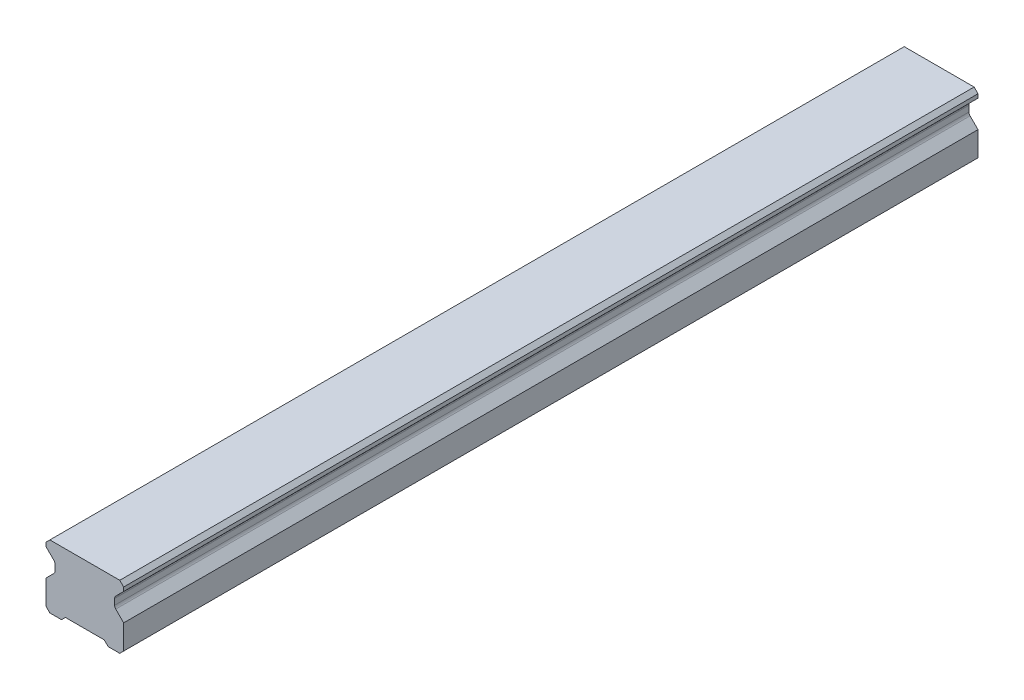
ISO-10303-21;
HEADER;
FILE_DESCRIPTION(('STEP AP214'),'2;1');
FILE_NAME('part.step','',(''),(''),'','','');
FILE_SCHEMA(('AUTOMOTIVE_DESIGN { 1 0 10303 214 1 1 1 1 }'));
ENDSEC;
DATA;
#1=APPLICATION_CONTEXT('core data for automotive mechanical design processes');
#2=APPLICATION_PROTOCOL_DEFINITION('international standard','automotive_design',2000,#1);
#3=PRODUCT_CONTEXT('',#1,'mechanical');
#4=PRODUCT('Part','Part','',(#3));
#5=PRODUCT_RELATED_PRODUCT_CATEGORY('part','',(#4));
#6=PRODUCT_DEFINITION_FORMATION('','',#4);
#7=PRODUCT_DEFINITION_CONTEXT('part definition',#1,'design');
#8=PRODUCT_DEFINITION('design','',#6,#7);
#9=PRODUCT_DEFINITION_SHAPE('','',#8);
#10=(LENGTH_UNIT() NAMED_UNIT(*) SI_UNIT(.MILLI.,.METRE.));
#11=(NAMED_UNIT(*) PLANE_ANGLE_UNIT() SI_UNIT($,.RADIAN.));
#12=(NAMED_UNIT(*) SI_UNIT($,.STERADIAN.) SOLID_ANGLE_UNIT());
#13=UNCERTAINTY_MEASURE_WITH_UNIT(LENGTH_MEASURE(1.E-05),#10,'distance_accuracy_value','');
#14=(GEOMETRIC_REPRESENTATION_CONTEXT(3) GLOBAL_UNCERTAINTY_ASSIGNED_CONTEXT((#13)) GLOBAL_UNIT_ASSIGNED_CONTEXT((#10,
#11,#12)) REPRESENTATION_CONTEXT('',''));
#15=CARTESIAN_POINT('',(0.,0.,0.));
#16=DIRECTION('',(0.,0.,1.));
#17=DIRECTION('',(1.,0.,0.));
#18=AXIS2_PLACEMENT_3D('',#15,#16,#17);
#19=CARTESIAN_POINT('',(0.,11.,-90.));
#20=DIRECTION('',(0.,-1.,0.));
#21=DIRECTION('',(0.,0.,-1.));
#22=AXIS2_PLACEMENT_3D('',#19,#20,#21);
#23=PLANE('',#22);
#24=CARTESIAN_POINT('',(0.,11.,-90.));
#25=DIRECTION('',(0.,-1.,0.));
#26=DIRECTION('',(0.,0.,-1.));
#27=AXIS2_PLACEMENT_3D('',#24,#25,#26);
#28=CIRCLE('',#27,2.5);
#29=CARTESIAN_POINT('',(0.,11.,-92.5));
#30=VERTEX_POINT('',#29);
#31=EDGE_CURVE('E42',#30,#30,#28,.T.);
#32=ORIENTED_EDGE('',*,*,#31,.F.);
#33=EDGE_LOOP('',(#32));
#34=FACE_BOUND('',#33,.T.);
#35=CARTESIAN_POINT('',(0.,11.,-90.));
#36=DIRECTION('',(0.,-1.,0.));
#37=DIRECTION('',(0.,0.,-1.));
#38=AXIS2_PLACEMENT_3D('',#35,#36,#37);
#39=CIRCLE('',#38,3.);
#40=CARTESIAN_POINT('',(0.,11.,-93.));
#41=VERTEX_POINT('',#40);
#42=EDGE_CURVE('E11',#41,#41,#39,.T.);
#43=ORIENTED_EDGE('',*,*,#42,.T.);
#44=EDGE_LOOP('',(#43));
#45=FACE_BOUND('',#44,.T.);
#46=ADVANCED_FACE('F39',(#34,#45),#23,.T.);
#47=CARTESIAN_POINT('',(0.,11.,-90.));
#48=DIRECTION('',(0.,-1.,0.));
#49=DIRECTION('',(0.,0.,-1.));
#50=AXIS2_PLACEMENT_3D('',#47,#48,#49);
#51=CYLINDRICAL_SURFACE('',#50,3.);
#52=ORIENTED_EDGE('',*,*,#42,.F.);
#53=EDGE_LOOP('',(#52));
#54=FACE_BOUND('',#53,.T.);
#55=CARTESIAN_POINT('',(0.,1.00000000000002,-90.));
#56=DIRECTION('',(0.,-1.,0.));
#57=DIRECTION('',(0.,0.,-1.));
#58=AXIS2_PLACEMENT_3D('',#55,#56,#57);
#59=CIRCLE('',#58,3.);
#60=CARTESIAN_POINT('',(0.,1.00000000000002,-93.));
#61=VERTEX_POINT('',#60);
#62=EDGE_CURVE('E48',#61,#61,#59,.T.);
#63=ORIENTED_EDGE('',*,*,#62,.T.);
#64=EDGE_LOOP('',(#63));
#65=FACE_BOUND('',#64,.T.);
#66=ADVANCED_FACE('F519',(#54,#65),#51,.F.);
#67=CARTESIAN_POINT('',(0.,11.,-30.));
#68=DIRECTION('',(0.,-1.,0.));
#69=DIRECTION('',(0.,0.,-1.));
#70=AXIS2_PLACEMENT_3D('',#67,#68,#69);
#71=PLANE('',#70);
#72=CARTESIAN_POINT('',(0.,11.,-30.));
#73=DIRECTION('',(0.,-1.,0.));
#74=DIRECTION('',(0.,0.,-1.));
#75=AXIS2_PLACEMENT_3D('',#72,#73,#74);
#76=CIRCLE('',#75,2.5);
#77=CARTESIAN_POINT('',(0.,11.,-32.5));
#78=VERTEX_POINT('',#77);
#79=EDGE_CURVE('E230',#78,#78,#76,.T.);
#80=ORIENTED_EDGE('',*,*,#79,.F.);
#81=EDGE_LOOP('',(#80));
#82=FACE_BOUND('',#81,.T.);
#83=CARTESIAN_POINT('',(0.,11.,-30.));
#84=DIRECTION('',(0.,-1.,0.));
#85=DIRECTION('',(0.,0.,-1.));
#86=AXIS2_PLACEMENT_3D('',#83,#84,#85);
#87=CIRCLE('',#86,3.);
#88=CARTESIAN_POINT('',(0.,11.,-33.));
#89=VERTEX_POINT('',#88);
#90=EDGE_CURVE('E500',#89,#89,#87,.T.);
#91=ORIENTED_EDGE('',*,*,#90,.T.);
#92=EDGE_LOOP('',(#91));
#93=FACE_BOUND('',#92,.T.);
#94=ADVANCED_FACE('F524',(#82,#93),#71,.T.);
#95=CARTESIAN_POINT('',(0.,11.,-30.));
#96=DIRECTION('',(0.,-1.,0.));
#97=DIRECTION('',(0.,0.,-1.));
#98=AXIS2_PLACEMENT_3D('',#95,#96,#97);
#99=CYLINDRICAL_SURFACE('',#98,3.);
#100=ORIENTED_EDGE('',*,*,#90,.F.);
#101=EDGE_LOOP('',(#100));
#102=FACE_BOUND('',#101,.T.);
#103=CARTESIAN_POINT('',(0.,1.00000000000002,-30.));
#104=DIRECTION('',(0.,-1.,0.));
#105=DIRECTION('',(0.,0.,-1.));
#106=AXIS2_PLACEMENT_3D('',#103,#104,#105);
#107=CIRCLE('',#106,3.);
#108=CARTESIAN_POINT('',(0.,1.00000000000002,-33.));
#109=VERTEX_POINT('',#108);
#110=EDGE_CURVE('E496',#109,#109,#107,.T.);
#111=ORIENTED_EDGE('',*,*,#110,.T.);
#112=EDGE_LOOP('',(#111));
#113=FACE_BOUND('',#112,.T.);
#114=ADVANCED_FACE('F628',(#102,#113),#99,.F.);
#115=CARTESIAN_POINT('',(10.,0.,110.));
#116=DIRECTION('',(0.,1.,0.));
#117=DIRECTION('',(-1.,0.,0.));
#118=AXIS2_PLACEMENT_3D('',#115,#116,#117);
#119=PLANE('',#118);
#120=DIRECTION('',(1.,0.,0.));
#121=VECTOR('',#120,1.);
#122=CARTESIAN_POINT('',(10.,0.,-110.));
#123=LINE('',#122,#121);
#124=CARTESIAN_POINT('',(-9.,0.,-110.));
#125=VERTEX_POINT('',#124);
#126=CARTESIAN_POINT('',(-6.00000000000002,0.,-110.));
#127=VERTEX_POINT('',#126);
#128=EDGE_CURVE('E380',#125,#127,#123,.T.);
#129=ORIENTED_EDGE('',*,*,#128,.T.);
#130=DIRECTION('',(0.,0.,1.));
#131=VECTOR('',#130,1.);
#132=CARTESIAN_POINT('',(-6.00000000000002,0.,-110.));
#133=LINE('',#132,#131);
#134=CARTESIAN_POINT('',(-6.00000000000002,0.,110.));
#135=VERTEX_POINT('',#134);
#136=EDGE_CURVE('E285',#127,#135,#133,.T.);
#137=ORIENTED_EDGE('',*,*,#136,.T.);
#138=DIRECTION('',(1.,0.,0.));
#139=VECTOR('',#138,1.);
#140=CARTESIAN_POINT('',(10.,0.,110.));
#141=LINE('',#140,#139);
#142=CARTESIAN_POINT('',(-9.,0.,110.));
#143=VERTEX_POINT('',#142);
#144=EDGE_CURVE('E361',#143,#135,#141,.T.);
#145=ORIENTED_EDGE('',*,*,#144,.F.);
#146=DIRECTION('',(0.,0.,-1.));
#147=VECTOR('',#146,1.);
#148=CARTESIAN_POINT('',(-9.,0.,110.));
#149=LINE('',#148,#147);
#150=EDGE_CURVE('E432',#143,#125,#149,.T.);
#151=ORIENTED_EDGE('',*,*,#150,.T.);
#152=EDGE_LOOP('',(#129,#137,#145,#151));
#153=FACE_BOUND('',#152,.T.);
#154=ADVANCED_FACE('F593',(#153),#119,.F.);
#155=CARTESIAN_POINT('',(-10.,16.3,110.));
#156=DIRECTION('',(1.,0.,0.));
#157=DIRECTION('',(0.,1.,0.));
#158=AXIS2_PLACEMENT_3D('',#155,#156,#157);
#159=PLANE('',#158);
#160=DIRECTION('',(0.,-1.,0.));
#161=VECTOR('',#160,1.);
#162=CARTESIAN_POINT('',(-10.,16.3,110.));
#163=LINE('',#162,#161);
#164=CARTESIAN_POINT('',(-10.,15.3,110.));
#165=VERTEX_POINT('',#164);
#166=CARTESIAN_POINT('',(-10.,14.3,110.));
#167=VERTEX_POINT('',#166);
#168=EDGE_CURVE('E355',#165,#167,#163,.T.);
#169=ORIENTED_EDGE('',*,*,#168,.F.);
#170=DIRECTION('',(0.,0.,-1.));
#171=VECTOR('',#170,1.);
#172=CARTESIAN_POINT('',(-10.,15.3,110.));
#173=LINE('',#172,#171);
#174=CARTESIAN_POINT('',(-10.,15.3,-110.));
#175=VERTEX_POINT('',#174);
#176=EDGE_CURVE('E374',#165,#175,#173,.T.);
#177=ORIENTED_EDGE('',*,*,#176,.T.);
#178=DIRECTION('',(0.,-1.,0.));
#179=VECTOR('',#178,1.);
#180=CARTESIAN_POINT('',(-10.,16.3,-110.));
#181=LINE('',#180,#179);
#182=CARTESIAN_POINT('',(-10.,14.3,-110.));
#183=VERTEX_POINT('',#182);
#184=EDGE_CURVE('E375',#175,#183,#181,.T.);
#185=ORIENTED_EDGE('',*,*,#184,.T.);
#186=DIRECTION('',(0.,0.,1.));
#187=VECTOR('',#186,1.);
#188=CARTESIAN_POINT('',(-10.,14.3,-110.));
#189=LINE('',#188,#187);
#190=EDGE_CURVE('E309',#183,#167,#189,.T.);
#191=ORIENTED_EDGE('',*,*,#190,.T.);
#192=EDGE_LOOP('',(#169,#177,#185,#191));
#193=FACE_BOUND('',#192,.T.);
#194=ADVANCED_FACE('F597',(#193),#159,.F.);
#195=CARTESIAN_POINT('',(10.,16.3,110.));
#196=DIRECTION('',(-1.,0.,0.));
#197=DIRECTION('',(0.,-1.,0.));
#198=AXIS2_PLACEMENT_3D('',#195,#196,#197);
#199=PLANE('',#198);
#200=DIRECTION('',(0.,1.,0.));
#201=VECTOR('',#200,1.);
#202=CARTESIAN_POINT('',(10.,16.3,110.));
#203=LINE('',#202,#201);
#204=CARTESIAN_POINT('',(10.,0.999999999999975,110.));
#205=VERTEX_POINT('',#204);
#206=CARTESIAN_POINT('',(10.,7.3,110.));
#207=VERTEX_POINT('',#206);
#208=EDGE_CURVE('E366',#205,#207,#203,.T.);
#209=ORIENTED_EDGE('',*,*,#208,.F.);
#210=DIRECTION('',(0.,0.,-1.));
#211=VECTOR('',#210,1.);
#212=CARTESIAN_POINT('',(10.,0.999999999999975,110.));
#213=LINE('',#212,#211);
#214=CARTESIAN_POINT('',(10.,0.999999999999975,-110.));
#215=VERTEX_POINT('',#214);
#216=EDGE_CURVE('E438',#205,#215,#213,.T.);
#217=ORIENTED_EDGE('',*,*,#216,.T.);
#218=DIRECTION('',(0.,1.,0.));
#219=VECTOR('',#218,1.);
#220=CARTESIAN_POINT('',(10.,16.3,-110.));
#221=LINE('',#220,#219);
#222=CARTESIAN_POINT('',(10.,7.3,-110.));
#223=VERTEX_POINT('',#222);
#224=EDGE_CURVE('E385',#215,#223,#221,.T.);
#225=ORIENTED_EDGE('',*,*,#224,.T.);
#226=DIRECTION('',(0.,0.,1.));
#227=VECTOR('',#226,1.);
#228=CARTESIAN_POINT('',(10.,7.3,-110.));
#229=LINE('',#228,#227);
#230=EDGE_CURVE('E340',#223,#207,#229,.T.);
#231=ORIENTED_EDGE('',*,*,#230,.T.);
#232=EDGE_LOOP('',(#209,#217,#225,#231));
#233=FACE_BOUND('',#232,.T.);
#234=ADVANCED_FACE('F588',(#233),#199,.F.);
#235=CARTESIAN_POINT('',(-10.,7.3,-110.));
#236=VERTEX_POINT('',#235);
#237=CARTESIAN_POINT('',(-10.,1.00000000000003,-110.));
#238=VERTEX_POINT('',#237);
#239=EDGE_CURVE('E324',#236,#238,#181,.T.);
#240=ORIENTED_EDGE('',*,*,#239,.T.);
#241=DIRECTION('',(0.,0.,1.));
#242=VECTOR('',#241,1.);
#243=CARTESIAN_POINT('',(-10.,1.00000000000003,110.));
#244=LINE('',#243,#242);
#245=CARTESIAN_POINT('',(-10.,1.00000000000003,110.));
#246=VERTEX_POINT('',#245);
#247=EDGE_CURVE('E435',#238,#246,#244,.T.);
#248=ORIENTED_EDGE('',*,*,#247,.T.);
#249=CARTESIAN_POINT('',(-10.,7.3,110.));
#250=VERTEX_POINT('',#249);
#251=EDGE_CURVE('E360',#250,#246,#163,.T.);
#252=ORIENTED_EDGE('',*,*,#251,.F.);
#253=DIRECTION('',(0.,0.,1.));
#254=VECTOR('',#253,1.);
#255=CARTESIAN_POINT('',(-10.,7.3,-110.));
#256=LINE('',#255,#254);
#257=EDGE_CURVE('E321',#236,#250,#256,.T.);
#258=ORIENTED_EDGE('',*,*,#257,.F.);
#259=EDGE_LOOP('',(#240,#248,#252,#258));
#260=FACE_BOUND('',#259,.T.);
#261=ADVANCED_FACE('F591',(#260),#159,.F.);
#262=CARTESIAN_POINT('',(6.00000000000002,0.,110.));
#263=VERTEX_POINT('',#262);
#264=CARTESIAN_POINT('',(9.,0.,110.));
#265=VERTEX_POINT('',#264);
#266=EDGE_CURVE('E359',#263,#265,#141,.T.);
#267=ORIENTED_EDGE('',*,*,#266,.F.);
#268=DIRECTION('',(0.,0.,1.));
#269=VECTOR('',#268,1.);
#270=CARTESIAN_POINT('',(6.00000000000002,0.,-110.));
#271=LINE('',#270,#269);
#272=CARTESIAN_POINT('',(6.00000000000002,0.,-110.));
#273=VERTEX_POINT('',#272);
#274=EDGE_CURVE('E275',#273,#263,#271,.T.);
#275=ORIENTED_EDGE('',*,*,#274,.F.);
#276=CARTESIAN_POINT('',(9.,0.,-110.));
#277=VERTEX_POINT('',#276);
#278=EDGE_CURVE('E379',#273,#277,#123,.T.);
#279=ORIENTED_EDGE('',*,*,#278,.T.);
#280=DIRECTION('',(0.,0.,1.));
#281=VECTOR('',#280,1.);
#282=CARTESIAN_POINT('',(9.,0.,110.));
#283=LINE('',#282,#281);
#284=EDGE_CURVE('E428',#277,#265,#283,.T.);
#285=ORIENTED_EDGE('',*,*,#284,.T.);
#286=EDGE_LOOP('',(#267,#275,#279,#285));
#287=FACE_BOUND('',#286,.T.);
#288=ADVANCED_FACE('F586',(#287),#119,.F.);
#289=CARTESIAN_POINT('',(10.,14.3,-110.));
#290=VERTEX_POINT('',#289);
#291=CARTESIAN_POINT('',(10.,15.3,-110.));
#292=VERTEX_POINT('',#291);
#293=EDGE_CURVE('E384',#290,#292,#221,.T.);
#294=ORIENTED_EDGE('',*,*,#293,.T.);
#295=DIRECTION('',(0.,0.,1.));
#296=VECTOR('',#295,1.);
#297=CARTESIAN_POINT('',(10.,15.3,110.));
#298=LINE('',#297,#296);
#299=CARTESIAN_POINT('',(10.,15.3,110.));
#300=VERTEX_POINT('',#299);
#301=EDGE_CURVE('E442',#292,#300,#298,.T.);
#302=ORIENTED_EDGE('',*,*,#301,.T.);
#303=CARTESIAN_POINT('',(10.,14.3,110.));
#304=VERTEX_POINT('',#303);
#305=EDGE_CURVE('E365',#304,#300,#203,.T.);
#306=ORIENTED_EDGE('',*,*,#305,.F.);
#307=DIRECTION('',(0.,0.,1.));
#308=VECTOR('',#307,1.);
#309=CARTESIAN_POINT('',(10.,14.3,-110.));
#310=LINE('',#309,#308);
#311=EDGE_CURVE('E314',#290,#304,#310,.T.);
#312=ORIENTED_EDGE('',*,*,#311,.F.);
#313=EDGE_LOOP('',(#294,#302,#306,#312));
#314=FACE_BOUND('',#313,.T.);
#315=ADVANCED_FACE('F582',(#314),#199,.F.);
#316=CARTESIAN_POINT('',(10.,16.3,110.));
#317=DIRECTION('',(0.,-1.,0.));
#318=DIRECTION('',(0.,0.,-1.));
#319=AXIS2_PLACEMENT_3D('',#316,#317,#318);
#320=PLANE('',#319);
#321=DIRECTION('',(-1.,0.,0.));
#322=VECTOR('',#321,1.);
#323=CARTESIAN_POINT('',(10.,16.3,-110.));
#324=LINE('',#323,#322);
#325=CARTESIAN_POINT('',(9.00000000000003,16.3,-110.));
#326=VERTEX_POINT('',#325);
#327=CARTESIAN_POINT('',(-9.,16.3,-110.));
#328=VERTEX_POINT('',#327);
#329=EDGE_CURVE('E389',#326,#328,#324,.T.);
#330=ORIENTED_EDGE('',*,*,#329,.T.);
#331=DIRECTION('',(0.,0.,1.));
#332=VECTOR('',#331,1.);
#333=CARTESIAN_POINT('',(-9.,16.3,110.));
#334=LINE('',#333,#332);
#335=CARTESIAN_POINT('',(-9.,16.3,110.));
#336=VERTEX_POINT('',#335);
#337=EDGE_CURVE('E413',#328,#336,#334,.T.);
#338=ORIENTED_EDGE('',*,*,#337,.T.);
#339=DIRECTION('',(-1.,0.,0.));
#340=VECTOR('',#339,1.);
#341=CARTESIAN_POINT('',(10.,16.3,110.));
#342=LINE('',#341,#340);
#343=CARTESIAN_POINT('',(9.00000000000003,16.3,110.));
#344=VERTEX_POINT('',#343);
#345=EDGE_CURVE('E370',#344,#336,#342,.T.);
#346=ORIENTED_EDGE('',*,*,#345,.F.);
#347=DIRECTION('',(0.,0.,-1.));
#348=VECTOR('',#347,1.);
#349=CARTESIAN_POINT('',(9.00000000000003,16.3,110.));
#350=LINE('',#349,#348);
#351=EDGE_CURVE('E409',#344,#326,#350,.T.);
#352=ORIENTED_EDGE('',*,*,#351,.T.);
#353=EDGE_LOOP('',(#330,#338,#346,#352));
#354=FACE_BOUND('',#353,.T.);
#355=ADVANCED_FACE('F576',(#354),#320,.F.);
#356=CARTESIAN_POINT('',(0.,0.,110.));
#357=DIRECTION('',(0.,0.,-1.));
#358=DIRECTION('',(-1.,0.,0.));
#359=AXIS2_PLACEMENT_3D('',#356,#357,#358);
#360=PLANE('',#359);
#361=ORIENTED_EDGE('',*,*,#144,.T.);
#362=DIRECTION('',(-0.707106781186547,-0.707106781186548,0.));
#363=VECTOR('',#362,1.);
#364=CARTESIAN_POINT('',(-6.00000000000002,0.,110.));
#365=LINE('',#364,#363);
#366=CARTESIAN_POINT('',(-5.,1.00000000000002,110.));
#367=VERTEX_POINT('',#366);
#368=EDGE_CURVE('E268',#367,#135,#365,.T.);
#369=ORIENTED_EDGE('',*,*,#368,.F.);
#370=DIRECTION('',(-1.,0.,0.));
#371=VECTOR('',#370,1.);
#372=CARTESIAN_POINT('',(-5.,1.00000000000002,110.));
#373=LINE('',#372,#371);
#374=CARTESIAN_POINT('',(5.,1.00000000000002,110.));
#375=VERTEX_POINT('',#374);
#376=EDGE_CURVE('E279',#375,#367,#373,.T.);
#377=ORIENTED_EDGE('',*,*,#376,.F.);
#378=DIRECTION('',(-0.707106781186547,0.707106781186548,0.));
#379=VECTOR('',#378,1.);
#380=CARTESIAN_POINT('',(5.,1.00000000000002,110.));
#381=LINE('',#380,#379);
#382=EDGE_CURVE('E260',#263,#375,#381,.T.);
#383=ORIENTED_EDGE('',*,*,#382,.F.);
#384=ORIENTED_EDGE('',*,*,#266,.T.);
#385=DIRECTION('',(-0.707106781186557,-0.707106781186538,0.));
#386=VECTOR('',#385,1.);
#387=CARTESIAN_POINT('',(10.,0.999999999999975,110.));
#388=LINE('',#387,#386);
#389=EDGE_CURVE('E419',#265,#205,#388,.F.);
#390=ORIENTED_EDGE('',*,*,#389,.T.);
#391=ORIENTED_EDGE('',*,*,#208,.T.);
#392=DIRECTION('',(0.707106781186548,-0.707106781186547,0.));
#393=VECTOR('',#392,1.);
#394=CARTESIAN_POINT('',(10.,7.3,110.));
#395=LINE('',#394,#393);
#396=CARTESIAN_POINT('',(7.95955988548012,9.34044011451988,110.));
#397=VERTEX_POINT('',#396);
#398=EDGE_CURVE('E289',#397,#207,#395,.T.);
#399=ORIENTED_EDGE('',*,*,#398,.F.);
#400=CARTESIAN_POINT('',(8.66666666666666,10.0475468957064,110.));
#401=DIRECTION('',(0.,0.,-1.));
#402=DIRECTION('',(-1.,0.,0.));
#403=AXIS2_PLACEMENT_3D('',#400,#401,#402);
#404=CIRCLE('',#403,1.);
#405=CARTESIAN_POINT('',(7.66666666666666,10.0475468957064,110.));
#406=VERTEX_POINT('',#405);
#407=EDGE_CURVE('E473',#397,#406,#404,.T.);
#408=ORIENTED_EDGE('',*,*,#407,.T.);
#409=DIRECTION('',(0.,-1.,0.));
#410=VECTOR('',#409,1.);
#411=CARTESIAN_POINT('',(7.66666666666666,9.63333333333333,110.));
#412=LINE('',#411,#410);
#413=CARTESIAN_POINT('',(7.66666666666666,11.5524531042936,110.));
#414=VERTEX_POINT('',#413);
#415=EDGE_CURVE('E332',#414,#406,#412,.T.);
#416=ORIENTED_EDGE('',*,*,#415,.F.);
#417=CARTESIAN_POINT('',(8.66666666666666,11.5524531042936,110.));
#418=DIRECTION('',(0.,0.,-1.));
#419=DIRECTION('',(-1.,0.,0.));
#420=AXIS2_PLACEMENT_3D('',#417,#418,#419);
#421=CIRCLE('',#420,1.);
#422=CARTESIAN_POINT('',(7.95955988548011,12.2595598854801,110.));
#423=VERTEX_POINT('',#422);
#424=EDGE_CURVE('E479',#414,#423,#421,.T.);
#425=ORIENTED_EDGE('',*,*,#424,.T.);
#426=DIRECTION('',(-0.707106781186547,-0.707106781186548,0.));
#427=VECTOR('',#426,1.);
#428=CARTESIAN_POINT('',(7.66666666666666,11.9666666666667,110.));
#429=LINE('',#428,#427);
#430=EDGE_CURVE('E343',#304,#423,#429,.T.);
#431=ORIENTED_EDGE('',*,*,#430,.F.);
#432=ORIENTED_EDGE('',*,*,#305,.T.);
#433=DIRECTION('',(0.707106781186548,-0.707106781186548,0.));
#434=VECTOR('',#433,1.);
#435=CARTESIAN_POINT('',(9.00000000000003,16.3,110.));
#436=LINE('',#435,#434);
#437=EDGE_CURVE('E416',#300,#344,#436,.F.);
#438=ORIENTED_EDGE('',*,*,#437,.T.);
#439=ORIENTED_EDGE('',*,*,#345,.T.);
#440=DIRECTION('',(0.707106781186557,0.707106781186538,0.));
#441=VECTOR('',#440,1.);
#442=CARTESIAN_POINT('',(-10.,15.3,110.));
#443=LINE('',#442,#441);
#444=EDGE_CURVE('E425',#336,#165,#443,.F.);
#445=ORIENTED_EDGE('',*,*,#444,.T.);
#446=ORIENTED_EDGE('',*,*,#168,.T.);
#447=DIRECTION('',(-0.707106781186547,0.707106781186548,0.));
#448=VECTOR('',#447,1.);
#449=CARTESIAN_POINT('',(-7.66666666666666,11.9666666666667,110.));
#450=LINE('',#449,#448);
#451=CARTESIAN_POINT('',(-7.95955988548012,12.2595598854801,110.));
#452=VERTEX_POINT('',#451);
#453=EDGE_CURVE('E310',#452,#167,#450,.T.);
#454=ORIENTED_EDGE('',*,*,#453,.F.);
#455=CARTESIAN_POINT('',(-8.66666666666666,11.5524531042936,110.));
#456=DIRECTION('',(0.,0.,-1.));
#457=DIRECTION('',(-1.,0.,0.));
#458=AXIS2_PLACEMENT_3D('',#455,#456,#457);
#459=CIRCLE('',#458,1.);
#460=CARTESIAN_POINT('',(-7.66666666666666,11.5524531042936,110.));
#461=VERTEX_POINT('',#460);
#462=EDGE_CURVE('E491',#452,#461,#459,.T.);
#463=ORIENTED_EDGE('',*,*,#462,.T.);
#464=DIRECTION('',(0.,1.,0.));
#465=VECTOR('',#464,1.);
#466=CARTESIAN_POINT('',(-7.66666666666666,9.63333333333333,110.));
#467=LINE('',#466,#465);
#468=CARTESIAN_POINT('',(-7.66666666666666,10.0475468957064,110.));
#469=VERTEX_POINT('',#468);
#470=EDGE_CURVE('E302',#469,#461,#467,.T.);
#471=ORIENTED_EDGE('',*,*,#470,.F.);
#472=CARTESIAN_POINT('',(-8.66666666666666,10.0475468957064,110.));
#473=DIRECTION('',(0.,0.,-1.));
#474=DIRECTION('',(-1.,0.,0.));
#475=AXIS2_PLACEMENT_3D('',#472,#473,#474);
#476=CIRCLE('',#475,1.);
#477=CARTESIAN_POINT('',(-7.95955988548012,9.34044011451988,110.));
#478=VERTEX_POINT('',#477);
#479=EDGE_CURVE('E485',#469,#478,#476,.T.);
#480=ORIENTED_EDGE('',*,*,#479,.T.);
#481=DIRECTION('',(0.707106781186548,0.707106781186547,0.));
#482=VECTOR('',#481,1.);
#483=CARTESIAN_POINT('',(-10.,7.3,110.));
#484=LINE('',#483,#482);
#485=EDGE_CURVE('E313',#250,#478,#484,.T.);
#486=ORIENTED_EDGE('',*,*,#485,.F.);
#487=ORIENTED_EDGE('',*,*,#251,.T.);
#488=DIRECTION('',(-0.707106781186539,0.707106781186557,0.));
#489=VECTOR('',#488,1.);
#490=CARTESIAN_POINT('',(-9.,0.,110.));
#491=LINE('',#490,#489);
#492=EDGE_CURVE('E422',#246,#143,#491,.F.);
#493=ORIENTED_EDGE('',*,*,#492,.T.);
#494=EDGE_LOOP('',(#361,#369,#377,#383,#384,#390,#391,#399,#408,#416,#425,#431,#432,#438,#439,
#445,#446,#454,#463,#471,#480,#486,#487,#493));
#495=FACE_BOUND('',#494,.T.);
#496=ADVANCED_FACE('F573',(#495),#360,.F.);
#497=CARTESIAN_POINT('',(0.,0.,-110.));
#498=DIRECTION('',(0.,0.,-1.));
#499=DIRECTION('',(-1.,0.,0.));
#500=AXIS2_PLACEMENT_3D('',#497,#498,#499);
#501=PLANE('',#500);
#502=DIRECTION('',(-0.707106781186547,-0.707106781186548,0.));
#503=VECTOR('',#502,1.);
#504=CARTESIAN_POINT('',(-6.00000000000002,0.,-110.));
#505=LINE('',#504,#503);
#506=CARTESIAN_POINT('',(-5.,1.00000000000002,-110.));
#507=VERTEX_POINT('',#506);
#508=EDGE_CURVE('E271',#507,#127,#505,.T.);
#509=ORIENTED_EDGE('',*,*,#508,.T.);
#510=ORIENTED_EDGE('',*,*,#128,.F.);
#511=DIRECTION('',(0.707106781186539,-0.707106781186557,0.));
#512=VECTOR('',#511,1.);
#513=CARTESIAN_POINT('',(-4.50000000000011,-4.5,-110.));
#514=LINE('',#513,#512);
#515=EDGE_CURVE('E403',#125,#238,#514,.F.);
#516=ORIENTED_EDGE('',*,*,#515,.T.);
#517=ORIENTED_EDGE('',*,*,#239,.F.);
#518=DIRECTION('',(0.707106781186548,0.707106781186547,0.));
#519=VECTOR('',#518,1.);
#520=CARTESIAN_POINT('',(-10.,7.3,-110.));
#521=LINE('',#520,#519);
#522=CARTESIAN_POINT('',(-7.95955988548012,9.34044011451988,-110.));
#523=VERTEX_POINT('',#522);
#524=EDGE_CURVE('E301',#236,#523,#521,.T.);
#525=ORIENTED_EDGE('',*,*,#524,.T.);
#526=CARTESIAN_POINT('',(-8.66666666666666,10.0475468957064,-110.));
#527=DIRECTION('',(0.,0.,-1.));
#528=DIRECTION('',(-1.,0.,0.));
#529=AXIS2_PLACEMENT_3D('',#526,#527,#528);
#530=CIRCLE('',#529,1.);
#531=CARTESIAN_POINT('',(-7.66666666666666,10.0475468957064,-110.));
#532=VERTEX_POINT('',#531);
#533=EDGE_CURVE('E488',#523,#532,#530,.F.);
#534=ORIENTED_EDGE('',*,*,#533,.T.);
#535=DIRECTION('',(0.,1.,0.));
#536=VECTOR('',#535,1.);
#537=CARTESIAN_POINT('',(-7.66666666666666,9.63333333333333,-110.));
#538=LINE('',#537,#536);
#539=CARTESIAN_POINT('',(-7.66666666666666,11.5524531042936,-110.));
#540=VERTEX_POINT('',#539);
#541=EDGE_CURVE('E306',#532,#540,#538,.T.);
#542=ORIENTED_EDGE('',*,*,#541,.T.);
#543=CARTESIAN_POINT('',(-8.66666666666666,11.5524531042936,-110.));
#544=DIRECTION('',(0.,0.,-1.));
#545=DIRECTION('',(-1.,0.,0.));
#546=AXIS2_PLACEMENT_3D('',#543,#544,#545);
#547=CIRCLE('',#546,1.);
#548=CARTESIAN_POINT('',(-7.95955988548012,12.2595598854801,-110.));
#549=VERTEX_POINT('',#548);
#550=EDGE_CURVE('E64',#540,#549,#547,.F.);
#551=ORIENTED_EDGE('',*,*,#550,.T.);
#552=DIRECTION('',(-0.707106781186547,0.707106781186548,0.));
#553=VECTOR('',#552,1.);
#554=CARTESIAN_POINT('',(-7.66666666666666,11.9666666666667,-110.));
#555=LINE('',#554,#553);
#556=EDGE_CURVE('E298',#549,#183,#555,.T.);
#557=ORIENTED_EDGE('',*,*,#556,.T.);
#558=ORIENTED_EDGE('',*,*,#184,.F.);
#559=DIRECTION('',(-0.707106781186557,-0.707106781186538,0.));
#560=VECTOR('',#559,1.);
#561=CARTESIAN_POINT('',(-12.6499999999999,12.6500000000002,-110.));
#562=LINE('',#561,#560);
#563=EDGE_CURVE('E406',#175,#328,#562,.F.);
#564=ORIENTED_EDGE('',*,*,#563,.T.);
#565=ORIENTED_EDGE('',*,*,#329,.F.);
#566=DIRECTION('',(-0.707106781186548,0.707106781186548,0.));
#567=VECTOR('',#566,1.);
#568=CARTESIAN_POINT('',(12.65,12.65,-110.));
#569=LINE('',#568,#567);
#570=EDGE_CURVE('E396',#326,#292,#569,.F.);
#571=ORIENTED_EDGE('',*,*,#570,.T.);
#572=ORIENTED_EDGE('',*,*,#293,.F.);
#573=DIRECTION('',(-0.707106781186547,-0.707106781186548,0.));
#574=VECTOR('',#573,1.);
#575=CARTESIAN_POINT('',(7.66666666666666,11.9666666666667,-110.));
#576=LINE('',#575,#574);
#577=CARTESIAN_POINT('',(7.95955988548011,12.2595598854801,-110.));
#578=VERTEX_POINT('',#577);
#579=EDGE_CURVE('E331',#290,#578,#576,.T.);
#580=ORIENTED_EDGE('',*,*,#579,.T.);
#581=CARTESIAN_POINT('',(8.66666666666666,11.5524531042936,-110.));
#582=DIRECTION('',(0.,0.,-1.));
#583=DIRECTION('',(-1.,0.,0.));
#584=AXIS2_PLACEMENT_3D('',#581,#582,#583);
#585=CIRCLE('',#584,1.);
#586=CARTESIAN_POINT('',(7.66666666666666,11.5524531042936,-110.));
#587=VERTEX_POINT('',#586);
#588=EDGE_CURVE('E482',#578,#587,#585,.F.);
#589=ORIENTED_EDGE('',*,*,#588,.T.);
#590=DIRECTION('',(0.,-1.,0.));
#591=VECTOR('',#590,1.);
#592=CARTESIAN_POINT('',(7.66666666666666,9.63333333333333,-110.));
#593=LINE('',#592,#591);
#594=CARTESIAN_POINT('',(7.66666666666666,10.0475468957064,-110.));
#595=VERTEX_POINT('',#594);
#596=EDGE_CURVE('E336',#587,#595,#593,.T.);
#597=ORIENTED_EDGE('',*,*,#596,.T.);
#598=CARTESIAN_POINT('',(8.66666666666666,10.0475468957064,-110.));
#599=DIRECTION('',(0.,0.,-1.));
#600=DIRECTION('',(-1.,0.,0.));
#601=AXIS2_PLACEMENT_3D('',#598,#599,#600);
#602=CIRCLE('',#601,1.);
#603=CARTESIAN_POINT('',(7.95955988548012,9.34044011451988,-110.));
#604=VERTEX_POINT('',#603);
#605=EDGE_CURVE('E476',#595,#604,#602,.F.);
#606=ORIENTED_EDGE('',*,*,#605,.T.);
#607=DIRECTION('',(0.707106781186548,-0.707106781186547,0.));
#608=VECTOR('',#607,1.);
#609=CARTESIAN_POINT('',(10.,7.3,-110.));
#610=LINE('',#609,#608);
#611=EDGE_CURVE('E328',#604,#223,#610,.T.);
#612=ORIENTED_EDGE('',*,*,#611,.T.);
#613=ORIENTED_EDGE('',*,*,#224,.F.);
#614=DIRECTION('',(0.707106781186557,0.707106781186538,0.));
#615=VECTOR('',#614,1.);
#616=CARTESIAN_POINT('',(4.49999999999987,-4.5,-110.));
#617=LINE('',#616,#615);
#618=EDGE_CURVE('E399',#215,#277,#617,.F.);
#619=ORIENTED_EDGE('',*,*,#618,.T.);
#620=ORIENTED_EDGE('',*,*,#278,.F.);
#621=DIRECTION('',(-0.707106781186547,0.707106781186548,0.));
#622=VECTOR('',#621,1.);
#623=CARTESIAN_POINT('',(5.,1.00000000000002,-110.));
#624=LINE('',#623,#622);
#625=CARTESIAN_POINT('',(5.,1.00000000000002,-110.));
#626=VERTEX_POINT('',#625);
#627=EDGE_CURVE('E264',#273,#626,#624,.T.);
#628=ORIENTED_EDGE('',*,*,#627,.T.);
#629=DIRECTION('',(-1.,0.,0.));
#630=VECTOR('',#629,1.);
#631=CARTESIAN_POINT('',(-5.,1.00000000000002,-110.));
#632=LINE('',#631,#630);
#633=EDGE_CURVE('E56',#626,#507,#632,.T.);
#634=ORIENTED_EDGE('',*,*,#633,.T.);
#635=EDGE_LOOP('',(#509,#510,#516,#517,#525,#534,#542,#551,#557,#558,#564,#565,#571,#572,#580,
#589,#597,#606,#612,#613,#619,#620,#628,#634));
#636=FACE_BOUND('',#635,.T.);
#637=ADVANCED_FACE('F571',(#636),#501,.T.);
#638=CARTESIAN_POINT('',(10.,7.3,-110.));
#639=DIRECTION('',(-0.707106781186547,-0.707106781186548,0.));
#640=DIRECTION('',(0.707106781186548,-0.707106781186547,0.));
#641=AXIS2_PLACEMENT_3D('',#638,#639,#640);
#642=PLANE('',#641);
#643=ORIENTED_EDGE('',*,*,#611,.F.);
#644=DIRECTION('',(0.,0.,1.));
#645=VECTOR('',#644,1.);
#646=CARTESIAN_POINT('',(7.95955988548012,9.34044011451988,110.));
#647=LINE('',#646,#645);
#648=EDGE_CURVE('E445',#604,#397,#647,.T.);
#649=ORIENTED_EDGE('',*,*,#648,.T.);
#650=ORIENTED_EDGE('',*,*,#398,.T.);
#651=ORIENTED_EDGE('',*,*,#230,.F.);
#652=EDGE_LOOP('',(#643,#649,#650,#651));
#653=FACE_BOUND('',#652,.T.);
#654=ADVANCED_FACE('F564',(#653),#642,.F.);
#655=CARTESIAN_POINT('',(7.66666666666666,9.63333333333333,-110.));
#656=DIRECTION('',(-1.,0.,0.));
#657=DIRECTION('',(0.,-1.,0.));
#658=AXIS2_PLACEMENT_3D('',#655,#656,#657);
#659=PLANE('',#658);
#660=ORIENTED_EDGE('',*,*,#415,.T.);
#661=DIRECTION('',(0.,0.,1.));
#662=VECTOR('',#661,1.);
#663=CARTESIAN_POINT('',(7.66666666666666,10.0475468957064,-110.));
#664=LINE('',#663,#662);
#665=EDGE_CURVE('E453',#406,#595,#664,.F.);
#666=ORIENTED_EDGE('',*,*,#665,.T.);
#667=ORIENTED_EDGE('',*,*,#596,.F.);
#668=DIRECTION('',(0.,0.,1.));
#669=VECTOR('',#668,1.);
#670=CARTESIAN_POINT('',(7.66666666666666,11.5524531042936,110.));
#671=LINE('',#670,#669);
#672=EDGE_CURVE('E449',#587,#414,#671,.T.);
#673=ORIENTED_EDGE('',*,*,#672,.T.);
#674=EDGE_LOOP('',(#660,#666,#667,#673));
#675=FACE_BOUND('',#674,.T.);
#676=ADVANCED_FACE('F561',(#675),#659,.F.);
#677=CARTESIAN_POINT('',(7.66666666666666,11.9666666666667,-110.));
#678=DIRECTION('',(-0.707106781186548,0.707106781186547,0.));
#679=DIRECTION('',(-0.707106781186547,-0.707106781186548,0.));
#680=AXIS2_PLACEMENT_3D('',#677,#678,#679);
#681=PLANE('',#680);
#682=ORIENTED_EDGE('',*,*,#430,.T.);
#683=DIRECTION('',(0.,0.,1.));
#684=VECTOR('',#683,1.);
#685=CARTESIAN_POINT('',(7.95955988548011,12.2595598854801,-110.));
#686=LINE('',#685,#684);
#687=EDGE_CURVE('E456',#423,#578,#686,.F.);
#688=ORIENTED_EDGE('',*,*,#687,.T.);
#689=ORIENTED_EDGE('',*,*,#579,.F.);
#690=ORIENTED_EDGE('',*,*,#311,.T.);
#691=EDGE_LOOP('',(#682,#688,#689,#690));
#692=FACE_BOUND('',#691,.T.);
#693=ADVANCED_FACE('F559',(#692),#681,.F.);
#694=CARTESIAN_POINT('',(-7.66666666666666,11.9666666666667,-110.));
#695=DIRECTION('',(0.707106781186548,0.707106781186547,0.));
#696=DIRECTION('',(-0.707106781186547,0.707106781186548,0.));
#697=AXIS2_PLACEMENT_3D('',#694,#695,#696);
#698=PLANE('',#697);
#699=ORIENTED_EDGE('',*,*,#556,.F.);
#700=DIRECTION('',(0.,0.,1.));
#701=VECTOR('',#700,1.);
#702=CARTESIAN_POINT('',(-7.95955988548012,12.2595598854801,110.));
#703=LINE('',#702,#701);
#704=EDGE_CURVE('E469',#549,#452,#703,.T.);
#705=ORIENTED_EDGE('',*,*,#704,.T.);
#706=ORIENTED_EDGE('',*,*,#453,.T.);
#707=ORIENTED_EDGE('',*,*,#190,.F.);
#708=EDGE_LOOP('',(#699,#705,#706,#707));
#709=FACE_BOUND('',#708,.T.);
#710=ADVANCED_FACE('F551',(#709),#698,.F.);
#711=CARTESIAN_POINT('',(-7.66666666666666,9.63333333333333,-110.));
#712=DIRECTION('',(1.,0.,0.));
#713=DIRECTION('',(0.,1.,0.));
#714=AXIS2_PLACEMENT_3D('',#711,#712,#713);
#715=PLANE('',#714);
#716=ORIENTED_EDGE('',*,*,#541,.F.);
#717=DIRECTION('',(0.,0.,1.));
#718=VECTOR('',#717,1.);
#719=CARTESIAN_POINT('',(-7.66666666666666,10.0475468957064,110.));
#720=LINE('',#719,#718);
#721=EDGE_CURVE('E462',#532,#469,#720,.T.);
#722=ORIENTED_EDGE('',*,*,#721,.T.);
#723=ORIENTED_EDGE('',*,*,#470,.T.);
#724=DIRECTION('',(0.,0.,1.));
#725=VECTOR('',#724,1.);
#726=CARTESIAN_POINT('',(-7.66666666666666,11.5524531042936,-110.));
#727=LINE('',#726,#725);
#728=EDGE_CURVE('E459',#461,#540,#727,.F.);
#729=ORIENTED_EDGE('',*,*,#728,.T.);
#730=EDGE_LOOP('',(#716,#722,#723,#729));
#731=FACE_BOUND('',#730,.T.);
#732=ADVANCED_FACE('F547',(#731),#715,.F.);
#733=CARTESIAN_POINT('',(-10.,7.3,-110.));
#734=DIRECTION('',(0.707106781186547,-0.707106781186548,0.));
#735=DIRECTION('',(0.707106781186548,0.707106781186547,0.));
#736=AXIS2_PLACEMENT_3D('',#733,#734,#735);
#737=PLANE('',#736);
#738=ORIENTED_EDGE('',*,*,#485,.T.);
#739=DIRECTION('',(0.,0.,1.));
#740=VECTOR('',#739,1.);
#741=CARTESIAN_POINT('',(-7.95955988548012,9.34044011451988,-110.));
#742=LINE('',#741,#740);
#743=EDGE_CURVE('E466',#478,#523,#742,.F.);
#744=ORIENTED_EDGE('',*,*,#743,.T.);
#745=ORIENTED_EDGE('',*,*,#524,.F.);
#746=ORIENTED_EDGE('',*,*,#257,.T.);
#747=EDGE_LOOP('',(#738,#744,#745,#746));
#748=FACE_BOUND('',#747,.T.);
#749=ADVANCED_FACE('F550',(#748),#737,.F.);
#750=CARTESIAN_POINT('',(-10.,15.3,110.));
#751=DIRECTION('',(0.707106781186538,-0.707106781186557,0.));
#752=DIRECTION('',(0.,0.,-1.));
#753=AXIS2_PLACEMENT_3D('',#750,#751,#752);
#754=PLANE('',#753);
#755=ORIENTED_EDGE('',*,*,#444,.F.);
#756=ORIENTED_EDGE('',*,*,#337,.F.);
#757=ORIENTED_EDGE('',*,*,#563,.F.);
#758=ORIENTED_EDGE('',*,*,#176,.F.);
#759=EDGE_LOOP('',(#755,#756,#757,#758));
#760=FACE_BOUND('',#759,.T.);
#761=ADVANCED_FACE('F555',(#760),#754,.F.);
#762=CARTESIAN_POINT('',(-9.,0.,110.));
#763=DIRECTION('',(0.707106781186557,0.707106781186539,0.));
#764=DIRECTION('',(0.,0.,-1.));
#765=AXIS2_PLACEMENT_3D('',#762,#763,#764);
#766=PLANE('',#765);
#767=ORIENTED_EDGE('',*,*,#492,.F.);
#768=ORIENTED_EDGE('',*,*,#247,.F.);
#769=ORIENTED_EDGE('',*,*,#515,.F.);
#770=ORIENTED_EDGE('',*,*,#150,.F.);
#771=EDGE_LOOP('',(#767,#768,#769,#770));
#772=FACE_BOUND('',#771,.T.);
#773=ADVANCED_FACE('F600',(#772),#766,.F.);
#774=CARTESIAN_POINT('',(10.,0.999999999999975,110.));
#775=DIRECTION('',(-0.707106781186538,0.707106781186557,0.));
#776=DIRECTION('',(0.,0.,-1.));
#777=AXIS2_PLACEMENT_3D('',#774,#775,#776);
#778=PLANE('',#777);
#779=ORIENTED_EDGE('',*,*,#389,.F.);
#780=ORIENTED_EDGE('',*,*,#284,.F.);
#781=ORIENTED_EDGE('',*,*,#618,.F.);
#782=ORIENTED_EDGE('',*,*,#216,.F.);
#783=EDGE_LOOP('',(#779,#780,#781,#782));
#784=FACE_BOUND('',#783,.T.);
#785=ADVANCED_FACE('F604',(#784),#778,.F.);
#786=CARTESIAN_POINT('',(9.00000000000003,16.3,110.));
#787=DIRECTION('',(-0.707106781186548,-0.707106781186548,0.));
#788=DIRECTION('',(0.,0.,-1.));
#789=AXIS2_PLACEMENT_3D('',#786,#787,#788);
#790=PLANE('',#789);
#791=ORIENTED_EDGE('',*,*,#437,.F.);
#792=ORIENTED_EDGE('',*,*,#301,.F.);
#793=ORIENTED_EDGE('',*,*,#570,.F.);
#794=ORIENTED_EDGE('',*,*,#351,.F.);
#795=EDGE_LOOP('',(#791,#792,#793,#794));
#796=FACE_BOUND('',#795,.T.);
#797=ADVANCED_FACE('F608',(#796),#790,.F.);
#798=CARTESIAN_POINT('',(8.66666666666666,10.0475468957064,-110.));
#799=DIRECTION('',(0.,0.,-1.));
#800=DIRECTION('',(-1.,0.,0.));
#801=AXIS2_PLACEMENT_3D('',#798,#799,#800);
#802=CYLINDRICAL_SURFACE('',#801,1.);
#803=ORIENTED_EDGE('',*,*,#605,.F.);
#804=ORIENTED_EDGE('',*,*,#665,.F.);
#805=ORIENTED_EDGE('',*,*,#407,.F.);
#806=ORIENTED_EDGE('',*,*,#648,.F.);
#807=EDGE_LOOP('',(#803,#804,#805,#806));
#808=FACE_BOUND('',#807,.T.);
#809=ADVANCED_FACE('F612',(#808),#802,.F.);
#810=CARTESIAN_POINT('',(8.66666666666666,11.5524531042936,-110.));
#811=DIRECTION('',(0.,0.,-1.));
#812=DIRECTION('',(-1.,0.,0.));
#813=AXIS2_PLACEMENT_3D('',#810,#811,#812);
#814=CYLINDRICAL_SURFACE('',#813,1.);
#815=ORIENTED_EDGE('',*,*,#588,.F.);
#816=ORIENTED_EDGE('',*,*,#687,.F.);
#817=ORIENTED_EDGE('',*,*,#424,.F.);
#818=ORIENTED_EDGE('',*,*,#672,.F.);
#819=EDGE_LOOP('',(#815,#816,#817,#818));
#820=FACE_BOUND('',#819,.T.);
#821=ADVANCED_FACE('F616',(#820),#814,.F.);
#822=CARTESIAN_POINT('',(-8.66666666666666,10.0475468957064,-110.));
#823=DIRECTION('',(0.,0.,-1.));
#824=DIRECTION('',(-1.,0.,0.));
#825=AXIS2_PLACEMENT_3D('',#822,#823,#824);
#826=CYLINDRICAL_SURFACE('',#825,1.);
#827=ORIENTED_EDGE('',*,*,#533,.F.);
#828=ORIENTED_EDGE('',*,*,#743,.F.);
#829=ORIENTED_EDGE('',*,*,#479,.F.);
#830=ORIENTED_EDGE('',*,*,#721,.F.);
#831=EDGE_LOOP('',(#827,#828,#829,#830));
#832=FACE_BOUND('',#831,.T.);
#833=ADVANCED_FACE('F620',(#832),#826,.F.);
#834=CARTESIAN_POINT('',(-8.66666666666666,11.5524531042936,-110.));
#835=DIRECTION('',(0.,0.,-1.));
#836=DIRECTION('',(-1.,0.,0.));
#837=AXIS2_PLACEMENT_3D('',#834,#835,#836);
#838=CYLINDRICAL_SURFACE('',#837,1.);
#839=ORIENTED_EDGE('',*,*,#550,.F.);
#840=ORIENTED_EDGE('',*,*,#728,.F.);
#841=ORIENTED_EDGE('',*,*,#462,.F.);
#842=ORIENTED_EDGE('',*,*,#704,.F.);
#843=EDGE_LOOP('',(#839,#840,#841,#842));
#844=FACE_BOUND('',#843,.T.);
#845=ADVANCED_FACE('F540',(#844),#838,.F.);
#846=CARTESIAN_POINT('',(-6.00000000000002,0.,-110.));
#847=DIRECTION('',(-0.707106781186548,0.707106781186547,0.));
#848=DIRECTION('',(-0.707106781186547,-0.707106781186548,0.));
#849=AXIS2_PLACEMENT_3D('',#846,#847,#848);
#850=PLANE('',#849);
#851=ORIENTED_EDGE('',*,*,#368,.T.);
#852=ORIENTED_EDGE('',*,*,#136,.F.);
#853=ORIENTED_EDGE('',*,*,#508,.F.);
#854=DIRECTION('',(0.,0.,1.));
#855=VECTOR('',#854,1.);
#856=CARTESIAN_POINT('',(-5.,1.00000000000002,-110.));
#857=LINE('',#856,#855);
#858=EDGE_CURVE('E290',#507,#367,#857,.T.);
#859=ORIENTED_EDGE('',*,*,#858,.T.);
#860=EDGE_LOOP('',(#851,#852,#853,#859));
#861=FACE_BOUND('',#860,.T.);
#862=ADVANCED_FACE('F530',(#861),#850,.F.);
#863=CARTESIAN_POINT('',(-5.,1.00000000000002,-110.));
#864=DIRECTION('',(0.,1.,0.));
#865=DIRECTION('',(0.,0.,1.));
#866=AXIS2_PLACEMENT_3D('',#863,#864,#865);
#867=PLANE('',#866);
#868=CARTESIAN_POINT('',(0.,1.00000000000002,30.));
#869=DIRECTION('',(0.,-1.,0.));
#870=DIRECTION('',(0.,0.,-1.));
#871=AXIS2_PLACEMENT_3D('',#868,#869,#870);
#872=CIRCLE('',#871,3.);
#873=CARTESIAN_POINT('',(0.,1.00000000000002,27.));
#874=VERTEX_POINT('',#873);
#875=EDGE_CURVE('E240',#874,#874,#872,.T.);
#876=ORIENTED_EDGE('',*,*,#875,.F.);
#877=EDGE_LOOP('',(#876));
#878=FACE_BOUND('',#877,.T.);
#879=CARTESIAN_POINT('',(0.,1.00000000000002,90.));
#880=DIRECTION('',(0.,-1.,0.));
#881=DIRECTION('',(0.,0.,-1.));
#882=AXIS2_PLACEMENT_3D('',#879,#880,#881);
#883=CIRCLE('',#882,3.);
#884=CARTESIAN_POINT('',(0.,1.00000000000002,87.));
#885=VERTEX_POINT('',#884);
#886=EDGE_CURVE('E256',#885,#885,#883,.T.);
#887=ORIENTED_EDGE('',*,*,#886,.F.);
#888=EDGE_LOOP('',(#887));
#889=FACE_BOUND('',#888,.T.);
#890=ORIENTED_EDGE('',*,*,#376,.T.);
#891=ORIENTED_EDGE('',*,*,#858,.F.);
#892=ORIENTED_EDGE('',*,*,#633,.F.);
#893=DIRECTION('',(0.,0.,1.));
#894=VECTOR('',#893,1.);
#895=CARTESIAN_POINT('',(5.,1.00000000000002,-110.));
#896=LINE('',#895,#894);
#897=EDGE_CURVE('E293',#626,#375,#896,.T.);
#898=ORIENTED_EDGE('',*,*,#897,.T.);
#899=EDGE_LOOP('',(#890,#891,#892,#898));
#900=FACE_BOUND('',#899,.T.);
#901=ORIENTED_EDGE('',*,*,#110,.F.);
#902=EDGE_LOOP('',(#901));
#903=FACE_BOUND('',#902,.T.);
#904=ORIENTED_EDGE('',*,*,#62,.F.);
#905=EDGE_LOOP('',(#904));
#906=FACE_BOUND('',#905,.T.);
#907=ADVANCED_FACE('F527',(#878,#889,#900,#903,#906),#867,.F.);
#908=CARTESIAN_POINT('',(5.,1.00000000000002,-110.));
#909=DIRECTION('',(0.707106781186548,0.707106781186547,0.));
#910=DIRECTION('',(-0.707106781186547,0.707106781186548,0.));
#911=AXIS2_PLACEMENT_3D('',#908,#909,#910);
#912=PLANE('',#911);
#913=ORIENTED_EDGE('',*,*,#382,.T.);
#914=ORIENTED_EDGE('',*,*,#897,.F.);
#915=ORIENTED_EDGE('',*,*,#627,.F.);
#916=ORIENTED_EDGE('',*,*,#274,.T.);
#917=EDGE_LOOP('',(#913,#914,#915,#916));
#918=FACE_BOUND('',#917,.T.);
#919=ADVANCED_FACE('F529',(#918),#912,.F.);
#920=CARTESIAN_POINT('',(0.,11.,90.));
#921=DIRECTION('',(0.,-1.,0.));
#922=DIRECTION('',(0.,0.,-1.));
#923=AXIS2_PLACEMENT_3D('',#920,#921,#922);
#924=CYLINDRICAL_SURFACE('',#923,3.);
#925=CARTESIAN_POINT('',(0.,11.,90.));
#926=DIRECTION('',(0.,-1.,0.));
#927=DIRECTION('',(0.,0.,-1.));
#928=AXIS2_PLACEMENT_3D('',#925,#926,#927);
#929=CIRCLE('',#928,3.);
#930=CARTESIAN_POINT('',(0.,11.,87.));
#931=VERTEX_POINT('',#930);
#932=EDGE_CURVE('E257',#931,#931,#929,.T.);
#933=ORIENTED_EDGE('',*,*,#932,.F.);
#934=EDGE_LOOP('',(#933));
#935=FACE_BOUND('',#934,.T.);
#936=ORIENTED_EDGE('',*,*,#886,.T.);
#937=EDGE_LOOP('',(#936));
#938=FACE_BOUND('',#937,.T.);
#939=ADVANCED_FACE('F537',(#935,#938),#924,.F.);
#940=CARTESIAN_POINT('',(0.,11.,90.));
#941=DIRECTION('',(0.,-1.,0.));
#942=DIRECTION('',(0.,0.,-1.));
#943=AXIS2_PLACEMENT_3D('',#940,#941,#942);
#944=PLANE('',#943);
#945=CARTESIAN_POINT('',(0.,11.,90.));
#946=DIRECTION('',(0.,-1.,0.));
#947=DIRECTION('',(0.,0.,-1.));
#948=AXIS2_PLACEMENT_3D('',#945,#946,#947);
#949=CIRCLE('',#948,2.5);
#950=CARTESIAN_POINT('',(0.,11.,87.5));
#951=VERTEX_POINT('',#950);
#952=EDGE_CURVE('E252',#951,#951,#949,.T.);
#953=ORIENTED_EDGE('',*,*,#952,.F.);
#954=EDGE_LOOP('',(#953));
#955=FACE_BOUND('',#954,.T.);
#956=ORIENTED_EDGE('',*,*,#932,.T.);
#957=EDGE_LOOP('',(#956));
#958=FACE_BOUND('',#957,.T.);
#959=ADVANCED_FACE('F740',(#955,#958),#944,.T.);
#960=CARTESIAN_POINT('',(0.,14.,90.));
#961=DIRECTION('',(0.,-1.,0.));
#962=DIRECTION('',(0.,0.,-1.));
#963=AXIS2_PLACEMENT_3D('',#960,#961,#962);
#964=CYLINDRICAL_SURFACE('',#963,2.5);
#965=CARTESIAN_POINT('',(0.,14.,90.));
#966=DIRECTION('',(0.,-1.,0.));
#967=DIRECTION('',(0.,0.,-1.));
#968=AXIS2_PLACEMENT_3D('',#965,#966,#967);
#969=CIRCLE('',#968,2.5);
#970=CARTESIAN_POINT('',(0.,14.,87.5));
#971=VERTEX_POINT('',#970);
#972=EDGE_CURVE('E248',#971,#971,#969,.T.);
#973=CARTESIAN_POINT('',(0.,11.,87.5));
#974=CARTESIAN_POINT('',(0.,11.03125,87.5));
#975=CARTESIAN_POINT('',(0.,11.0625,87.5));
#976=CARTESIAN_POINT('',(0.,11.125,87.5));
#977=CARTESIAN_POINT('',(0.,11.15625,87.5));
#978=CARTESIAN_POINT('',(0.,11.21875,87.5));
#979=CARTESIAN_POINT('',(0.,11.25,87.5));
#980=CARTESIAN_POINT('',(0.,11.3125,87.5));
#981=CARTESIAN_POINT('',(0.,11.34375,87.5));
#982=CARTESIAN_POINT('',(0.,11.40625,87.5));
#983=CARTESIAN_POINT('',(0.,11.4375,87.5));
#984=CARTESIAN_POINT('',(0.,11.5,87.5));
#985=CARTESIAN_POINT('',(0.,11.53125,87.5));
#986=CARTESIAN_POINT('',(0.,11.59375,87.5));
#987=CARTESIAN_POINT('',(0.,11.625,87.5));
#988=CARTESIAN_POINT('',(0.,11.6875,87.5));
#989=CARTESIAN_POINT('',(0.,11.71875,87.5));
#990=CARTESIAN_POINT('',(0.,11.78125,87.5));
#991=CARTESIAN_POINT('',(0.,11.8125,87.5));
#992=CARTESIAN_POINT('',(0.,11.875,87.5));
#993=CARTESIAN_POINT('',(0.,11.90625,87.5));
#994=CARTESIAN_POINT('',(0.,11.96875,87.5));
#995=CARTESIAN_POINT('',(0.,12.,87.5));
#996=CARTESIAN_POINT('',(0.,12.0625,87.5));
#997=CARTESIAN_POINT('',(0.,12.09375,87.5));
#998=CARTESIAN_POINT('',(0.,12.15625,87.5));
#999=CARTESIAN_POINT('',(0.,12.1875,87.5));
#1000=CARTESIAN_POINT('',(0.,12.25,87.5));
#1001=CARTESIAN_POINT('',(0.,12.28125,87.5));
#1002=CARTESIAN_POINT('',(0.,12.34375,87.5));
#1003=CARTESIAN_POINT('',(0.,12.375,87.5));
#1004=CARTESIAN_POINT('',(0.,12.4375,87.5));
#1005=CARTESIAN_POINT('',(0.,12.46875,87.5));
#1006=CARTESIAN_POINT('',(0.,12.53125,87.5));
#1007=CARTESIAN_POINT('',(0.,12.5625,87.5));
#1008=CARTESIAN_POINT('',(0.,12.625,87.5));
#1009=CARTESIAN_POINT('',(0.,12.65625,87.5));
#1010=CARTESIAN_POINT('',(0.,12.71875,87.5));
#1011=CARTESIAN_POINT('',(0.,12.75,87.5));
#1012=CARTESIAN_POINT('',(0.,12.8125,87.5));
#1013=CARTESIAN_POINT('',(0.,12.84375,87.5));
#1014=CARTESIAN_POINT('',(0.,12.90625,87.5));
#1015=CARTESIAN_POINT('',(0.,12.9375,87.5));
#1016=CARTESIAN_POINT('',(0.,13.,87.5));
#1017=CARTESIAN_POINT('',(0.,13.03125,87.5));
#1018=CARTESIAN_POINT('',(0.,13.09375,87.5));
#1019=CARTESIAN_POINT('',(0.,13.125,87.5));
#1020=CARTESIAN_POINT('',(0.,13.1875,87.5));
#1021=CARTESIAN_POINT('',(0.,13.21875,87.5));
#1022=CARTESIAN_POINT('',(0.,13.28125,87.5));
#1023=CARTESIAN_POINT('',(0.,13.3125,87.5));
#1024=CARTESIAN_POINT('',(0.,13.375,87.5));
#1025=CARTESIAN_POINT('',(0.,13.40625,87.5));
#1026=CARTESIAN_POINT('',(0.,13.46875,87.5));
#1027=CARTESIAN_POINT('',(0.,13.5,87.5));
#1028=CARTESIAN_POINT('',(0.,13.5625,87.5));
#1029=CARTESIAN_POINT('',(0.,13.59375,87.5));
#1030=CARTESIAN_POINT('',(0.,13.65625,87.5));
#1031=CARTESIAN_POINT('',(0.,13.6875,87.5));
#1032=CARTESIAN_POINT('',(0.,13.75,87.5));
#1033=CARTESIAN_POINT('',(0.,13.78125,87.5));
#1034=CARTESIAN_POINT('',(0.,13.84375,87.5));
#1035=CARTESIAN_POINT('',(0.,13.875,87.5));
#1036=CARTESIAN_POINT('',(0.,13.9375,87.5));
#1037=CARTESIAN_POINT('',(0.,13.96875,87.5));
#1038=CARTESIAN_POINT('',(0.,14.,87.5));
#1039=B_SPLINE_CURVE_WITH_KNOTS('',3,(#973,#974,#975,#976,#977,#978,#979,#980,#981,#982,#983,
#984,#985,#986,#987,#988,#989,#990,#991,#992,#993,#994,#995,#996,#997,#998,#999,#1000,#1001,
#1002,#1003,#1004,#1005,#1006,#1007,#1008,#1009,#1010,#1011,#1012,#1013,#1014,#1015,#1016,#1017,
#1018,#1019,#1020,#1021,#1022,#1023,#1024,#1025,#1026,#1027,#1028,#1029,#1030,#1031,#1032,#1033,
#1034,#1035,#1036,#1037,#1038),.UNSPECIFIED.,.F.,.F.,(4,2,2,2,2,2,2,2,2,2,2,2,2,2,2,2,2,2,2,2,2,
2,2,2,2,2,2,2,2,2,2,2,4),(0.,0.0937500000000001,0.1875,0.281249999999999,0.374999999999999,
0.468749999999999,0.562499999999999,0.656249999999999,0.749999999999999,0.843749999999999,
0.937499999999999,1.03125,1.125,1.21875,1.3125,1.40625,1.5,1.59375,1.6875,1.78125,1.875,1.96875,
2.0625,2.15625,2.25,2.34375,2.4375,2.53125,2.625,2.71875,2.8125,2.90625,3.),.UNSPECIFIED.);
#1040=EDGE_CURVE('BSEAM748',#951,#971,#1039,.T.);
#1041=ORIENTED_EDGE('',*,*,#952,.T.);
#1042=ORIENTED_EDGE('',*,*,#972,.F.);
#1043=ORIENTED_EDGE('',*,*,#1040,.T.);
#1044=ORIENTED_EDGE('',*,*,#1040,.F.);
#1045=EDGE_LOOP('',(#1041,#1043,#1042,#1044));
#1046=FACE_BOUND('',#1045,.T.);
#1047=ADVANCED_FACE('F748',(#1046),#964,.F.);
#1048=CARTESIAN_POINT('',(0.,14.,90.));
#1049=DIRECTION('',(0.,-1.,0.));
#1050=DIRECTION('',(0.,0.,-1.));
#1051=AXIS2_PLACEMENT_3D('',#1048,#1049,#1050);
#1052=CONICAL_SURFACE('',#1051,2.5,1.0471975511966);
#1053=CARTESIAN_POINT('',(0.,15.4433756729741,90.));
#1054=VERTEX_POINT('',#1053);
#1055=VERTEX_LOOP('',#1054);
#1056=FACE_BOUND('',#1055,.T.);
#1057=ORIENTED_EDGE('',*,*,#972,.T.);
#1058=EDGE_LOOP('',(#1057));
#1059=FACE_BOUND('',#1058,.T.);
#1060=ADVANCED_FACE('F757',(#1056,#1059),#1052,.F.);
#1061=CARTESIAN_POINT('',(0.,11.,30.));
#1062=DIRECTION('',(0.,-1.,0.));
#1063=DIRECTION('',(0.,0.,-1.));
#1064=AXIS2_PLACEMENT_3D('',#1061,#1062,#1063);
#1065=CYLINDRICAL_SURFACE('',#1064,3.);
#1066=CARTESIAN_POINT('',(0.,11.,30.));
#1067=DIRECTION('',(0.,-1.,0.));
#1068=DIRECTION('',(0.,0.,-1.));
#1069=AXIS2_PLACEMENT_3D('',#1066,#1067,#1068);
#1070=CIRCLE('',#1069,3.);
#1071=CARTESIAN_POINT('',(0.,11.,27.));
#1072=VERTEX_POINT('',#1071);
#1073=EDGE_CURVE('E244',#1072,#1072,#1070,.T.);
#1074=ORIENTED_EDGE('',*,*,#1073,.F.);
#1075=EDGE_LOOP('',(#1074));
#1076=FACE_BOUND('',#1075,.T.);
#1077=ORIENTED_EDGE('',*,*,#875,.T.);
#1078=EDGE_LOOP('',(#1077));
#1079=FACE_BOUND('',#1078,.T.);
#1080=ADVANCED_FACE('F766',(#1076,#1079),#1065,.F.);
#1081=CARTESIAN_POINT('',(0.,11.,30.));
#1082=DIRECTION('',(0.,-1.,0.));
#1083=DIRECTION('',(0.,0.,-1.));
#1084=AXIS2_PLACEMENT_3D('',#1081,#1082,#1083);
#1085=PLANE('',#1084);
#1086=CARTESIAN_POINT('',(0.,11.,30.));
#1087=DIRECTION('',(0.,-1.,0.));
#1088=DIRECTION('',(0.,0.,-1.));
#1089=AXIS2_PLACEMENT_3D('',#1086,#1087,#1088);
#1090=CIRCLE('',#1089,2.5);
#1091=CARTESIAN_POINT('',(0.,11.,27.5));
#1092=VERTEX_POINT('',#1091);
#1093=EDGE_CURVE('E223',#1092,#1092,#1090,.T.);
#1094=ORIENTED_EDGE('',*,*,#1093,.F.);
#1095=EDGE_LOOP('',(#1094));
#1096=FACE_BOUND('',#1095,.T.);
#1097=ORIENTED_EDGE('',*,*,#1073,.T.);
#1098=EDGE_LOOP('',(#1097));
#1099=FACE_BOUND('',#1098,.T.);
#1100=ADVANCED_FACE('F775',(#1096,#1099),#1085,.T.);
#1101=CARTESIAN_POINT('',(0.,14.,30.));
#1102=DIRECTION('',(0.,-1.,0.));
#1103=DIRECTION('',(0.,0.,-1.));
#1104=AXIS2_PLACEMENT_3D('',#1101,#1102,#1103);
#1105=CYLINDRICAL_SURFACE('',#1104,2.5);
#1106=CARTESIAN_POINT('',(0.,14.,30.));
#1107=DIRECTION('',(0.,-1.,0.));
#1108=DIRECTION('',(0.,0.,-1.));
#1109=AXIS2_PLACEMENT_3D('',#1106,#1107,#1108);
#1110=CIRCLE('',#1109,2.5);
#1111=CARTESIAN_POINT('',(0.,14.,27.5));
#1112=VERTEX_POINT('',#1111);
#1113=EDGE_CURVE('E220',#1112,#1112,#1110,.T.);
#1114=CARTESIAN_POINT('',(0.,11.,27.5));
#1115=CARTESIAN_POINT('',(0.,11.03125,27.5));
#1116=CARTESIAN_POINT('',(0.,11.0625,27.5));
#1117=CARTESIAN_POINT('',(0.,11.125,27.5));
#1118=CARTESIAN_POINT('',(0.,11.15625,27.5));
#1119=CARTESIAN_POINT('',(0.,11.21875,27.5));
#1120=CARTESIAN_POINT('',(0.,11.25,27.5));
#1121=CARTESIAN_POINT('',(0.,11.3125,27.5));
#1122=CARTESIAN_POINT('',(0.,11.34375,27.5));
#1123=CARTESIAN_POINT('',(0.,11.40625,27.5));
#1124=CARTESIAN_POINT('',(0.,11.4375,27.5));
#1125=CARTESIAN_POINT('',(0.,11.5,27.5));
#1126=CARTESIAN_POINT('',(0.,11.53125,27.5));
#1127=CARTESIAN_POINT('',(0.,11.59375,27.5));
#1128=CARTESIAN_POINT('',(0.,11.625,27.5));
#1129=CARTESIAN_POINT('',(0.,11.6875,27.5));
#1130=CARTESIAN_POINT('',(0.,11.71875,27.5));
#1131=CARTESIAN_POINT('',(0.,11.78125,27.5));
#1132=CARTESIAN_POINT('',(0.,11.8125,27.5));
#1133=CARTESIAN_POINT('',(0.,11.875,27.5));
#1134=CARTESIAN_POINT('',(0.,11.90625,27.5));
#1135=CARTESIAN_POINT('',(0.,11.96875,27.5));
#1136=CARTESIAN_POINT('',(0.,12.,27.5));
#1137=CARTESIAN_POINT('',(0.,12.0625,27.5));
#1138=CARTESIAN_POINT('',(0.,12.09375,27.5));
#1139=CARTESIAN_POINT('',(0.,12.15625,27.5));
#1140=CARTESIAN_POINT('',(0.,12.1875,27.5));
#1141=CARTESIAN_POINT('',(0.,12.25,27.5));
#1142=CARTESIAN_POINT('',(0.,12.28125,27.5));
#1143=CARTESIAN_POINT('',(0.,12.34375,27.5));
#1144=CARTESIAN_POINT('',(0.,12.375,27.5));
#1145=CARTESIAN_POINT('',(0.,12.4375,27.5));
#1146=CARTESIAN_POINT('',(0.,12.46875,27.5));
#1147=CARTESIAN_POINT('',(0.,12.53125,27.5));
#1148=CARTESIAN_POINT('',(0.,12.5625,27.5));
#1149=CARTESIAN_POINT('',(0.,12.625,27.5));
#1150=CARTESIAN_POINT('',(0.,12.65625,27.5));
#1151=CARTESIAN_POINT('',(0.,12.71875,27.5));
#1152=CARTESIAN_POINT('',(0.,12.75,27.5));
#1153=CARTESIAN_POINT('',(0.,12.8125,27.5));
#1154=CARTESIAN_POINT('',(0.,12.84375,27.5));
#1155=CARTESIAN_POINT('',(0.,12.90625,27.5));
#1156=CARTESIAN_POINT('',(0.,12.9375,27.5));
#1157=CARTESIAN_POINT('',(0.,13.,27.5));
#1158=CARTESIAN_POINT('',(0.,13.03125,27.5));
#1159=CARTESIAN_POINT('',(0.,13.09375,27.5));
#1160=CARTESIAN_POINT('',(0.,13.125,27.5));
#1161=CARTESIAN_POINT('',(0.,13.1875,27.5));
#1162=CARTESIAN_POINT('',(0.,13.21875,27.5));
#1163=CARTESIAN_POINT('',(0.,13.28125,27.5));
#1164=CARTESIAN_POINT('',(0.,13.3125,27.5));
#1165=CARTESIAN_POINT('',(0.,13.375,27.5));
#1166=CARTESIAN_POINT('',(0.,13.40625,27.5));
#1167=CARTESIAN_POINT('',(0.,13.46875,27.5));
#1168=CARTESIAN_POINT('',(0.,13.5,27.5));
#1169=CARTESIAN_POINT('',(0.,13.5625,27.5));
#1170=CARTESIAN_POINT('',(0.,13.59375,27.5));
#1171=CARTESIAN_POINT('',(0.,13.65625,27.5));
#1172=CARTESIAN_POINT('',(0.,13.6875,27.5));
#1173=CARTESIAN_POINT('',(0.,13.75,27.5));
#1174=CARTESIAN_POINT('',(0.,13.78125,27.5));
#1175=CARTESIAN_POINT('',(0.,13.84375,27.5));
#1176=CARTESIAN_POINT('',(0.,13.875,27.5));
#1177=CARTESIAN_POINT('',(0.,13.9375,27.5));
#1178=CARTESIAN_POINT('',(0.,13.96875,27.5));
#1179=CARTESIAN_POINT('',(0.,14.,27.5));
#1180=B_SPLINE_CURVE_WITH_KNOTS('',3,(#1114,#1115,#1116,#1117,#1118,#1119,#1120,#1121,#1122,
#1123,#1124,#1125,#1126,#1127,#1128,#1129,#1130,#1131,#1132,#1133,#1134,#1135,#1136,#1137,#1138,
#1139,#1140,#1141,#1142,#1143,#1144,#1145,#1146,#1147,#1148,#1149,#1150,#1151,#1152,#1153,#1154,
#1155,#1156,#1157,#1158,#1159,#1160,#1161,#1162,#1163,#1164,#1165,#1166,#1167,#1168,#1169,#1170,
#1171,#1172,#1173,#1174,#1175,#1176,#1177,#1178,#1179),.UNSPECIFIED.,.F.,.F.,(4,2,2,2,2,2,2,2,2,
2,2,2,2,2,2,2,2,2,2,2,2,2,2,2,2,2,2,2,2,2,2,2,4),(0.,0.0937500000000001,0.1875,
0.281249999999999,0.374999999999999,0.468749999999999,0.562499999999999,0.656249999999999,
0.749999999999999,0.843749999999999,0.937499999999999,1.03125,1.125,1.21875,1.3125,1.40625,1.5,
1.59375,1.6875,1.78125,1.875,1.96875,2.0625,2.15625,2.25,2.34375,2.4375,2.53125,2.625,2.71875,
2.8125,2.90625,3.),.UNSPECIFIED.);
#1181=EDGE_CURVE('BSEAM784',#1092,#1112,#1180,.T.);
#1182=ORIENTED_EDGE('',*,*,#1093,.T.);
#1183=ORIENTED_EDGE('',*,*,#1113,.F.);
#1184=ORIENTED_EDGE('',*,*,#1181,.T.);
#1185=ORIENTED_EDGE('',*,*,#1181,.F.);
#1186=EDGE_LOOP('',(#1182,#1184,#1183,#1185));
#1187=FACE_BOUND('',#1186,.T.);
#1188=ADVANCED_FACE('F784',(#1187),#1105,.F.);
#1189=CARTESIAN_POINT('',(0.,14.,-30.));
#1190=DIRECTION('',(0.,-1.,0.));
#1191=DIRECTION('',(0.,0.,-1.));
#1192=AXIS2_PLACEMENT_3D('',#1189,#1190,#1191);
#1193=CYLINDRICAL_SURFACE('',#1192,2.5);
#1194=CARTESIAN_POINT('',(0.,14.,-30.));
#1195=DIRECTION('',(0.,-1.,0.));
#1196=DIRECTION('',(0.,0.,-1.));
#1197=AXIS2_PLACEMENT_3D('',#1194,#1195,#1196);
#1198=CIRCLE('',#1197,2.5);
#1199=CARTESIAN_POINT('',(0.,14.,-32.5));
#1200=VERTEX_POINT('',#1199);
#1201=EDGE_CURVE('E224',#1200,#1200,#1198,.T.);
#1202=CARTESIAN_POINT('',(0.,11.,-32.5));
#1203=CARTESIAN_POINT('',(0.,11.03125,-32.5));
#1204=CARTESIAN_POINT('',(0.,11.0625,-32.5));
#1205=CARTESIAN_POINT('',(0.,11.125,-32.5));
#1206=CARTESIAN_POINT('',(0.,11.15625,-32.5));
#1207=CARTESIAN_POINT('',(0.,11.21875,-32.5));
#1208=CARTESIAN_POINT('',(0.,11.25,-32.5));
#1209=CARTESIAN_POINT('',(0.,11.3125,-32.5));
#1210=CARTESIAN_POINT('',(0.,11.34375,-32.5));
#1211=CARTESIAN_POINT('',(0.,11.40625,-32.5));
#1212=CARTESIAN_POINT('',(0.,11.4375,-32.5));
#1213=CARTESIAN_POINT('',(0.,11.5,-32.5));
#1214=CARTESIAN_POINT('',(0.,11.53125,-32.5));
#1215=CARTESIAN_POINT('',(0.,11.59375,-32.5));
#1216=CARTESIAN_POINT('',(0.,11.625,-32.5));
#1217=CARTESIAN_POINT('',(0.,11.6875,-32.5));
#1218=CARTESIAN_POINT('',(0.,11.71875,-32.5));
#1219=CARTESIAN_POINT('',(0.,11.78125,-32.5));
#1220=CARTESIAN_POINT('',(0.,11.8125,-32.5));
#1221=CARTESIAN_POINT('',(0.,11.875,-32.5));
#1222=CARTESIAN_POINT('',(0.,11.90625,-32.5));
#1223=CARTESIAN_POINT('',(0.,11.96875,-32.5));
#1224=CARTESIAN_POINT('',(0.,12.,-32.5));
#1225=CARTESIAN_POINT('',(0.,12.0625,-32.5));
#1226=CARTESIAN_POINT('',(0.,12.09375,-32.5));
#1227=CARTESIAN_POINT('',(0.,12.15625,-32.5));
#1228=CARTESIAN_POINT('',(0.,12.1875,-32.5));
#1229=CARTESIAN_POINT('',(0.,12.25,-32.5));
#1230=CARTESIAN_POINT('',(0.,12.28125,-32.5));
#1231=CARTESIAN_POINT('',(0.,12.34375,-32.5));
#1232=CARTESIAN_POINT('',(0.,12.375,-32.5));
#1233=CARTESIAN_POINT('',(0.,12.4375,-32.5));
#1234=CARTESIAN_POINT('',(0.,12.46875,-32.5));
#1235=CARTESIAN_POINT('',(0.,12.53125,-32.5));
#1236=CARTESIAN_POINT('',(0.,12.5625,-32.5));
#1237=CARTESIAN_POINT('',(0.,12.625,-32.5));
#1238=CARTESIAN_POINT('',(0.,12.65625,-32.5));
#1239=CARTESIAN_POINT('',(0.,12.71875,-32.5));
#1240=CARTESIAN_POINT('',(0.,12.75,-32.5));
#1241=CARTESIAN_POINT('',(0.,12.8125,-32.5));
#1242=CARTESIAN_POINT('',(0.,12.84375,-32.5));
#1243=CARTESIAN_POINT('',(0.,12.90625,-32.5));
#1244=CARTESIAN_POINT('',(0.,12.9375,-32.5));
#1245=CARTESIAN_POINT('',(0.,13.,-32.5));
#1246=CARTESIAN_POINT('',(0.,13.03125,-32.5));
#1247=CARTESIAN_POINT('',(0.,13.09375,-32.5));
#1248=CARTESIAN_POINT('',(0.,13.125,-32.5));
#1249=CARTESIAN_POINT('',(0.,13.1875,-32.5));
#1250=CARTESIAN_POINT('',(0.,13.21875,-32.5));
#1251=CARTESIAN_POINT('',(0.,13.28125,-32.5));
#1252=CARTESIAN_POINT('',(0.,13.3125,-32.5));
#1253=CARTESIAN_POINT('',(0.,13.375,-32.5));
#1254=CARTESIAN_POINT('',(0.,13.40625,-32.5));
#1255=CARTESIAN_POINT('',(0.,13.46875,-32.5));
#1256=CARTESIAN_POINT('',(0.,13.5,-32.5));
#1257=CARTESIAN_POINT('',(0.,13.5625,-32.5));
#1258=CARTESIAN_POINT('',(0.,13.59375,-32.5));
#1259=CARTESIAN_POINT('',(0.,13.65625,-32.5));
#1260=CARTESIAN_POINT('',(0.,13.6875,-32.5));
#1261=CARTESIAN_POINT('',(0.,13.75,-32.5));
#1262=CARTESIAN_POINT('',(0.,13.78125,-32.5));
#1263=CARTESIAN_POINT('',(0.,13.84375,-32.5));
#1264=CARTESIAN_POINT('',(0.,13.875,-32.5));
#1265=CARTESIAN_POINT('',(0.,13.9375,-32.5));
#1266=CARTESIAN_POINT('',(0.,13.96875,-32.5));
#1267=CARTESIAN_POINT('',(0.,14.,-32.5));
#1268=B_SPLINE_CURVE_WITH_KNOTS('',3,(#1202,#1203,#1204,#1205,#1206,#1207,#1208,#1209,#1210,
#1211,#1212,#1213,#1214,#1215,#1216,#1217,#1218,#1219,#1220,#1221,#1222,#1223,#1224,#1225,#1226,
#1227,#1228,#1229,#1230,#1231,#1232,#1233,#1234,#1235,#1236,#1237,#1238,#1239,#1240,#1241,#1242,
#1243,#1244,#1245,#1246,#1247,#1248,#1249,#1250,#1251,#1252,#1253,#1254,#1255,#1256,#1257,#1258,
#1259,#1260,#1261,#1262,#1263,#1264,#1265,#1266,#1267),.UNSPECIFIED.,.F.,.F.,(4,2,2,2,2,2,2,2,2,
2,2,2,2,2,2,2,2,2,2,2,2,2,2,2,2,2,2,2,2,2,2,2,4),(0.,0.0937500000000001,0.1875,
0.281249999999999,0.374999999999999,0.468749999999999,0.562499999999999,0.656249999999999,
0.749999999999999,0.843749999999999,0.937499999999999,1.03125,1.125,1.21875,1.3125,1.40625,1.5,
1.59375,1.6875,1.78125,1.875,1.96875,2.0625,2.15625,2.25,2.34375,2.4375,2.53125,2.625,2.71875,
2.8125,2.90625,3.),.UNSPECIFIED.);
#1269=EDGE_CURVE('BSEAM793',#78,#1200,#1268,.T.);
#1270=ORIENTED_EDGE('',*,*,#79,.T.);
#1271=ORIENTED_EDGE('',*,*,#1201,.F.);
#1272=ORIENTED_EDGE('',*,*,#1269,.T.);
#1273=ORIENTED_EDGE('',*,*,#1269,.F.);
#1274=EDGE_LOOP('',(#1270,#1272,#1271,#1273));
#1275=FACE_BOUND('',#1274,.T.);
#1276=ADVANCED_FACE('F793',(#1275),#1193,.F.);
#1277=CARTESIAN_POINT('',(0.,14.,-90.));
#1278=DIRECTION('',(0.,-1.,0.));
#1279=DIRECTION('',(0.,0.,-1.));
#1280=AXIS2_PLACEMENT_3D('',#1277,#1278,#1279);
#1281=CYLINDRICAL_SURFACE('',#1280,2.5);
#1282=CARTESIAN_POINT('',(0.,14.,-90.));
#1283=DIRECTION('',(0.,-1.,0.));
#1284=DIRECTION('',(0.,0.,-1.));
#1285=AXIS2_PLACEMENT_3D('',#1282,#1283,#1284);
#1286=CIRCLE('',#1285,2.5);
#1287=CARTESIAN_POINT('',(0.,14.,-92.5));
#1288=VERTEX_POINT('',#1287);
#1289=EDGE_CURVE('E234',#1288,#1288,#1286,.T.);
#1290=CARTESIAN_POINT('',(0.,11.,-92.5));
#1291=CARTESIAN_POINT('',(0.,11.03125,-92.5));
#1292=CARTESIAN_POINT('',(0.,11.0625,-92.5));
#1293=CARTESIAN_POINT('',(0.,11.125,-92.5));
#1294=CARTESIAN_POINT('',(0.,11.15625,-92.5));
#1295=CARTESIAN_POINT('',(0.,11.21875,-92.5));
#1296=CARTESIAN_POINT('',(0.,11.25,-92.5));
#1297=CARTESIAN_POINT('',(0.,11.3125,-92.5));
#1298=CARTESIAN_POINT('',(0.,11.34375,-92.5));
#1299=CARTESIAN_POINT('',(0.,11.40625,-92.5));
#1300=CARTESIAN_POINT('',(0.,11.4375,-92.5));
#1301=CARTESIAN_POINT('',(0.,11.5,-92.5));
#1302=CARTESIAN_POINT('',(0.,11.53125,-92.5));
#1303=CARTESIAN_POINT('',(0.,11.59375,-92.5));
#1304=CARTESIAN_POINT('',(0.,11.625,-92.5));
#1305=CARTESIAN_POINT('',(0.,11.6875,-92.5));
#1306=CARTESIAN_POINT('',(0.,11.71875,-92.5));
#1307=CARTESIAN_POINT('',(0.,11.78125,-92.5));
#1308=CARTESIAN_POINT('',(0.,11.8125,-92.5));
#1309=CARTESIAN_POINT('',(0.,11.875,-92.5));
#1310=CARTESIAN_POINT('',(0.,11.90625,-92.5));
#1311=CARTESIAN_POINT('',(0.,11.96875,-92.5));
#1312=CARTESIAN_POINT('',(0.,12.,-92.5));
#1313=CARTESIAN_POINT('',(0.,12.0625,-92.5));
#1314=CARTESIAN_POINT('',(0.,12.09375,-92.5));
#1315=CARTESIAN_POINT('',(0.,12.15625,-92.5));
#1316=CARTESIAN_POINT('',(0.,12.1875,-92.5));
#1317=CARTESIAN_POINT('',(0.,12.25,-92.5));
#1318=CARTESIAN_POINT('',(0.,12.28125,-92.5));
#1319=CARTESIAN_POINT('',(0.,12.34375,-92.5));
#1320=CARTESIAN_POINT('',(0.,12.375,-92.5));
#1321=CARTESIAN_POINT('',(0.,12.4375,-92.5));
#1322=CARTESIAN_POINT('',(0.,12.46875,-92.5));
#1323=CARTESIAN_POINT('',(0.,12.53125,-92.5));
#1324=CARTESIAN_POINT('',(0.,12.5625,-92.5));
#1325=CARTESIAN_POINT('',(0.,12.625,-92.5));
#1326=CARTESIAN_POINT('',(0.,12.65625,-92.5));
#1327=CARTESIAN_POINT('',(0.,12.71875,-92.5));
#1328=CARTESIAN_POINT('',(0.,12.75,-92.5));
#1329=CARTESIAN_POINT('',(0.,12.8125,-92.5));
#1330=CARTESIAN_POINT('',(0.,12.84375,-92.5));
#1331=CARTESIAN_POINT('',(0.,12.90625,-92.5));
#1332=CARTESIAN_POINT('',(0.,12.9375,-92.5));
#1333=CARTESIAN_POINT('',(0.,13.,-92.5));
#1334=CARTESIAN_POINT('',(0.,13.03125,-92.5));
#1335=CARTESIAN_POINT('',(0.,13.09375,-92.5));
#1336=CARTESIAN_POINT('',(0.,13.125,-92.5));
#1337=CARTESIAN_POINT('',(0.,13.1875,-92.5));
#1338=CARTESIAN_POINT('',(0.,13.21875,-92.5));
#1339=CARTESIAN_POINT('',(0.,13.28125,-92.5));
#1340=CARTESIAN_POINT('',(0.,13.3125,-92.5));
#1341=CARTESIAN_POINT('',(0.,13.375,-92.5));
#1342=CARTESIAN_POINT('',(0.,13.40625,-92.5));
#1343=CARTESIAN_POINT('',(0.,13.46875,-92.5));
#1344=CARTESIAN_POINT('',(0.,13.5,-92.5));
#1345=CARTESIAN_POINT('',(0.,13.5625,-92.5));
#1346=CARTESIAN_POINT('',(0.,13.59375,-92.5));
#1347=CARTESIAN_POINT('',(0.,13.65625,-92.5));
#1348=CARTESIAN_POINT('',(0.,13.6875,-92.5));
#1349=CARTESIAN_POINT('',(0.,13.75,-92.5));
#1350=CARTESIAN_POINT('',(0.,13.78125,-92.5));
#1351=CARTESIAN_POINT('',(0.,13.84375,-92.5));
#1352=CARTESIAN_POINT('',(0.,13.875,-92.5));
#1353=CARTESIAN_POINT('',(0.,13.9375,-92.5));
#1354=CARTESIAN_POINT('',(0.,13.96875,-92.5));
#1355=CARTESIAN_POINT('',(0.,14.,-92.5));
#1356=B_SPLINE_CURVE_WITH_KNOTS('',3,(#1290,#1291,#1292,#1293,#1294,#1295,#1296,#1297,#1298,
#1299,#1300,#1301,#1302,#1303,#1304,#1305,#1306,#1307,#1308,#1309,#1310,#1311,#1312,#1313,#1314,
#1315,#1316,#1317,#1318,#1319,#1320,#1321,#1322,#1323,#1324,#1325,#1326,#1327,#1328,#1329,#1330,
#1331,#1332,#1333,#1334,#1335,#1336,#1337,#1338,#1339,#1340,#1341,#1342,#1343,#1344,#1345,#1346,
#1347,#1348,#1349,#1350,#1351,#1352,#1353,#1354,#1355),.UNSPECIFIED.,.F.,.F.,(4,2,2,2,2,2,2,2,2,
2,2,2,2,2,2,2,2,2,2,2,2,2,2,2,2,2,2,2,2,2,2,2,4),(0.,0.0937500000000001,0.1875,
0.281249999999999,0.374999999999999,0.468749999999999,0.562499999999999,0.656249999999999,
0.749999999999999,0.843749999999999,0.937499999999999,1.03125,1.125,1.21875,1.3125,1.40625,1.5,
1.59375,1.6875,1.78125,1.875,1.96875,2.0625,2.15625,2.25,2.34375,2.4375,2.53125,2.625,2.71875,
2.8125,2.90625,3.),.UNSPECIFIED.);
#1357=EDGE_CURVE('BSEAM514',#30,#1288,#1356,.T.);
#1358=ORIENTED_EDGE('',*,*,#31,.T.);
#1359=ORIENTED_EDGE('',*,*,#1289,.F.);
#1360=ORIENTED_EDGE('',*,*,#1357,.T.);
#1361=ORIENTED_EDGE('',*,*,#1357,.F.);
#1362=EDGE_LOOP('',(#1358,#1360,#1359,#1361));
#1363=FACE_BOUND('',#1362,.T.);
#1364=ADVANCED_FACE('F514',(#1363),#1281,.F.);
#1365=CARTESIAN_POINT('',(0.,14.,-90.));
#1366=DIRECTION('',(0.,-1.,0.));
#1367=DIRECTION('',(0.,0.,-1.));
#1368=AXIS2_PLACEMENT_3D('',#1365,#1366,#1367);
#1369=CONICAL_SURFACE('',#1368,2.5,1.0471975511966);
#1370=CARTESIAN_POINT('',(0.,15.4433756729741,-90.));
#1371=VERTEX_POINT('',#1370);
#1372=VERTEX_LOOP('',#1371);
#1373=FACE_BOUND('',#1372,.T.);
#1374=ORIENTED_EDGE('',*,*,#1289,.T.);
#1375=EDGE_LOOP('',(#1374));
#1376=FACE_BOUND('',#1375,.T.);
#1377=ADVANCED_FACE('F809',(#1373,#1376),#1369,.F.);
#1378=CARTESIAN_POINT('',(0.,14.,-30.));
#1379=DIRECTION('',(0.,-1.,0.));
#1380=DIRECTION('',(0.,0.,-1.));
#1381=AXIS2_PLACEMENT_3D('',#1378,#1379,#1380);
#1382=CONICAL_SURFACE('',#1381,2.5,1.0471975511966);
#1383=CARTESIAN_POINT('',(0.,15.4433756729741,-30.));
#1384=VERTEX_POINT('',#1383);
#1385=VERTEX_LOOP('',#1384);
#1386=FACE_BOUND('',#1385,.T.);
#1387=ORIENTED_EDGE('',*,*,#1201,.T.);
#1388=EDGE_LOOP('',(#1387));
#1389=FACE_BOUND('',#1388,.T.);
#1390=ADVANCED_FACE('F216',(#1386,#1389),#1382,.F.);
#1391=CARTESIAN_POINT('',(0.,14.,30.));
#1392=DIRECTION('',(0.,-1.,0.));
#1393=DIRECTION('',(0.,0.,-1.));
#1394=AXIS2_PLACEMENT_3D('',#1391,#1392,#1393);
#1395=CONICAL_SURFACE('',#1394,2.5,1.0471975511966);
#1396=CARTESIAN_POINT('',(0.,15.4433756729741,30.));
#1397=VERTEX_POINT('',#1396);
#1398=VERTEX_LOOP('',#1397);
#1399=FACE_BOUND('',#1398,.T.);
#1400=ORIENTED_EDGE('',*,*,#1113,.T.);
#1401=EDGE_LOOP('',(#1400));
#1402=FACE_BOUND('',#1401,.T.);
#1403=ADVANCED_FACE('F213',(#1399,#1402),#1395,.F.);
#1404=CLOSED_SHELL('',(#46,#66,#94,#114,#154,#194,#234,#261,#288,#315,#355,#496,#637,#654,#676,
#693,#710,#732,#749,#761,#773,#785,#797,#809,#821,#833,#845,#862,#907,#919,#939,#959,#1047,
#1060,#1080,#1100,#1188,#1276,#1364,#1377,#1390,#1403));
#1405=MANIFOLD_SOLID_BREP('B2',#1404);
#1406=ADVANCED_BREP_SHAPE_REPRESENTATION('',(#18,#1405),#14);
#1407=SHAPE_DEFINITION_REPRESENTATION(#9,#1406);
ENDSEC;
END-ISO-10303-21;
